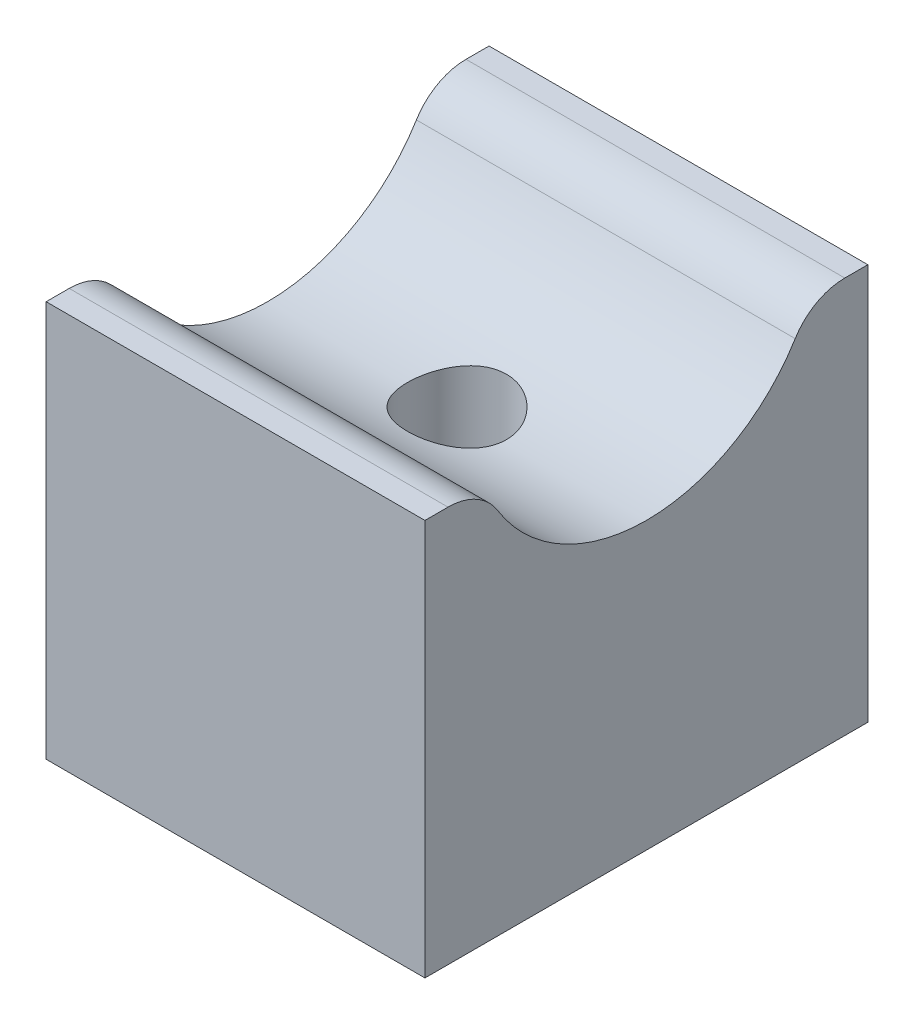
from build123d import *

# Parameters (mm, degrees)
SKIZZE2_W                                            = 32.5
SKIZZE2_H                                            = 38
GRUNDK_RPER_DEPTH                                    = 34
SCHNITT_LINEAR_AUSTRAGEN1_DEPTH                      = 43.202636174
SCHNITT_LINEAR_AUSTRAGEN1_DEPTH_BACK                 = 43.202636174
SKIZZE3_R                                            = 15
VERRUNDUNG1_R                                        = 5
STIRNSENKUNG_F_R_M8_ZYLINDERSCHRAUBE_MIT_D           = 8.5
STIRNSENKUNG_F_R_M8_ZYLINDERSCHRAUBE_MIT_CBORE_D     = 15
STIRNSENKUNG_F_R_M8_ZYLINDERSCHRAUBE_MIT_CBORE_DEPTH = 2


with BuildPart() as part:
    # Skizze2 → Grundk_rper (new body)
    with BuildSketch(Plane(origin=(0, 0, 0), x_dir=(1, 0, 0), z_dir=(0, 1, 0))):
        Rectangle(SKIZZE2_W, SKIZZE2_H)
    extrude(amount=GRUNDK_RPER_DEPTH)

    # Skizze3 → Schnitt-Linear austragen1 (cut, two sides: drawn at the far end of the back side and taken through both)
    with BuildSketch(Plane(origin=(0, 0, 0), x_dir=(0, 0, -1), z_dir=(1, 0, 0)).offset(-SCHNITT_LINEAR_AUSTRAGEN1_DEPTH_BACK)):
        with Locations((0, 39.5)):
            Circle(SKIZZE3_R)
    extrude(amount=SCHNITT_LINEAR_AUSTRAGEN1_DEPTH + SCHNITT_LINEAR_AUSTRAGEN1_DEPTH_BACK, mode=Mode.SUBTRACT)

    # Verrundung1
    verrundung1_edges = [part.edges().sort_by_distance(p)[0] for p in [
        (0, 34, -13.955285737),
        (0, 34, 13.955285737),
    ]]
    fillet(verrundung1_edges, radius=VERRUNDUNG1_R)

    # Stirnsenkung f_r M8 Zylinderschraube mit (through all)
    with Locations(Plane.XZ):
        with Locations((0, 0)):
            CounterBoreHole(STIRNSENKUNG_F_R_M8_ZYLINDERSCHRAUBE_MIT_D / 2, STIRNSENKUNG_F_R_M8_ZYLINDERSCHRAUBE_MIT_CBORE_D / 2, STIRNSENKUNG_F_R_M8_ZYLINDERSCHRAUBE_MIT_CBORE_DEPTH)


solid = part.part
